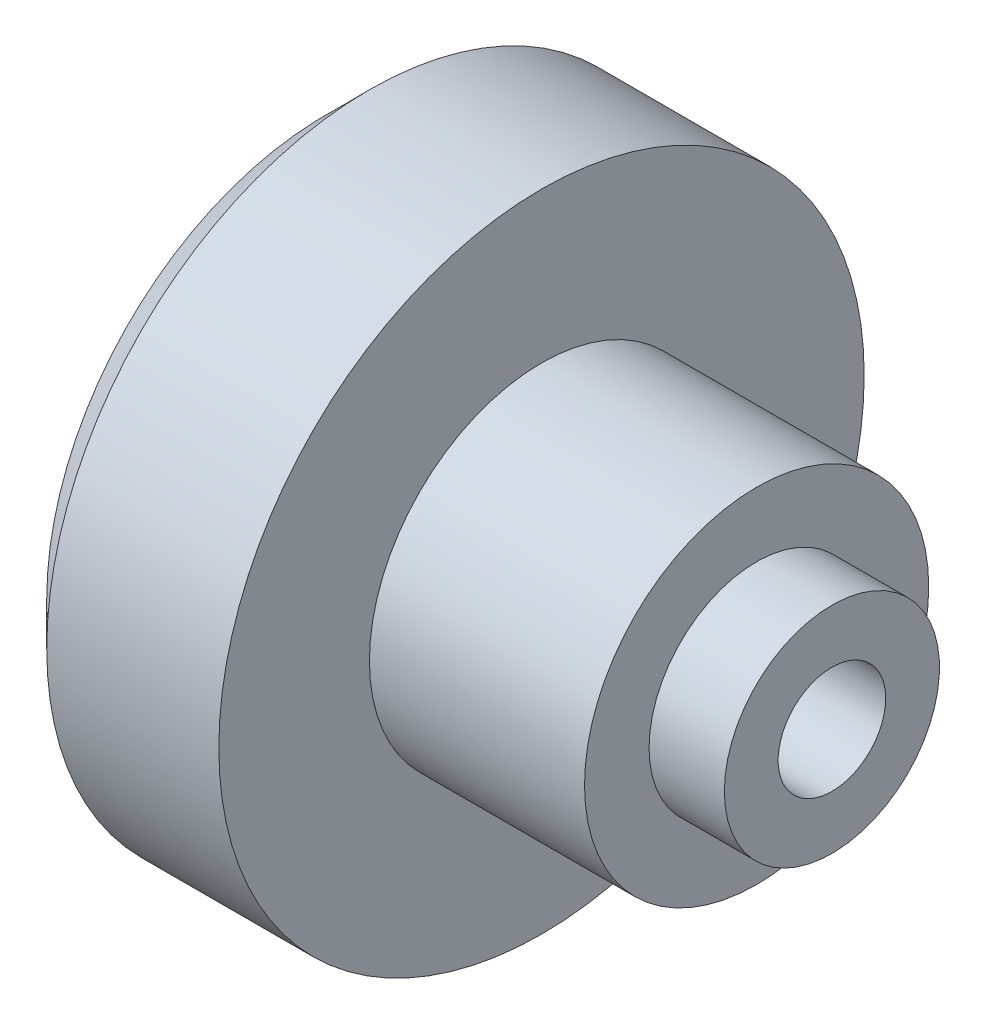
from build123d import *

# Parameters (mm, degrees)
M6_TAPPED_HOLE1_D     = 5
M6_TAPPED_HOLE1_DEPTH = 15
M6_TAPPED_HOLE1_TIP   = 1.502151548
CHAMFER1_SIZE         = 2


with BuildPart() as part:
    # Sketch1 → Revolve1 (revolve)
    with BuildSketch(Plane.XY, mode=Mode.PRIVATE) as revolve1_sk:
        Polygon((0, 0), (0, 15), (10, 15), (10, 8), (20, 8), (20, 5), (23.5, 5), (23.5, 0), align=None)
    revolve(revolve1_sk.sketch.rotate(Axis((0, 0, 0), (1, 0, 0)), 90), axis=Axis((0, 0, 0), (1, 0, 0)))

    # M6 Tapped Hole1
    with Locations(Plane(origin=(23.5, 0, 0), x_dir=(0, 0, 1), z_dir=(1, 0, 0))):
        with Locations((0, 0)):
            Hole(M6_TAPPED_HOLE1_D / 2, depth=M6_TAPPED_HOLE1_DEPTH)
            with Locations((0, 0, -(M6_TAPPED_HOLE1_DEPTH + M6_TAPPED_HOLE1_TIP / 2))):  # 118° drill point
                Cone(0, M6_TAPPED_HOLE1_D / 2, M6_TAPPED_HOLE1_TIP, mode=Mode.SUBTRACT)

    # Chamfer1
    chamfer1_edges = [part.edges().sort_by_distance(p)[0] for p in [
        (0, 0, -15),
    ]]
    chamfer(chamfer1_edges, length=CHAMFER1_SIZE)


solid = part.part
